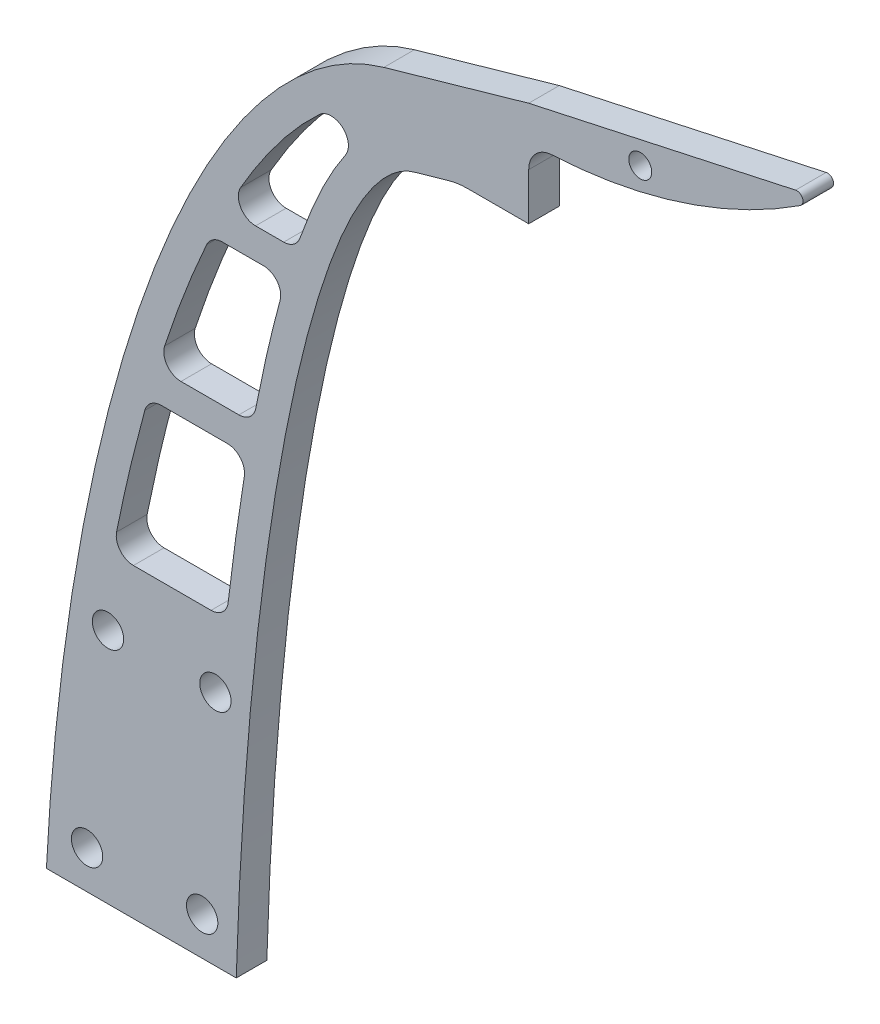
from build123d import *

# Parameters (mm, degrees)
BOSS_EXTRU_1_DEPTH                  = 4
CONG_1_R                            = 3.2
CONG_2_R                            = 0.8
ESQUISSE6_R                         = 1.5
ENL_V_MAT_EXTRU_2_DEPTH             = 4
CONG_4_R                            = 40
CONG_5_R                            = 55
CONG_6_R                            = 5
ENL_V_MAT_EXTRU_3_DEPTH             = 254.580270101
ENL_V_MAT_EXTRU_3_DEPTH_BACK        = 254.580270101
DIAM_TRE_DU_PER_AGE_4_1_4_1_1_D     = 4.1
DIAM_TRE_DU_PER_AGE_4_1_4_1_1_DEPTH = 60
DIAM_TRE_DU_PER_AGE_4_1_4_1_1_TIP   = 1.231764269
ENL_V_MAT_EXTRU_4_DEPTH             = 123.558173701


with BuildPart() as part:
    # Esquisse1 → Boss.-Extru.1 (new body)
    with BuildSketch(Plane.XY):
        with BuildLine():
            Line((-0.739497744, 9.26), (-0.739497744, 0))
            Line((-0.739497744, 0), (-8.739497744, 0))
            ThreePointArc((-8.739497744, 0), (-9.987816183, -0.086992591), (-11.21200252, -0.34628865))
            Line((-11.21200252, -0.34628865), (-15.724973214, -1.635717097))
            add(Edge.make_bspline(
                [(-15.724973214, -1.635717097), (-62.479329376, -14.994190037), (-34.146674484, -194.013963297)],
                knots=[0.059454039, 0.059454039, 0.059454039, 2.220460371, 2.220460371, 2.220460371], degree=2, weights=[1, 0.470884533, 1]))
            add(Edge.make_bspline(
                [(-34.146674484, -194.013963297), (27.242702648, -213.692623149), (101.257172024, -177.705354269)],
                knots=[3.821795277, 3.821795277, 3.821795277, 5.067449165, 5.067449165, 5.067449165], degree=2, weights=[1, 0.812232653, 1]))
            Line((101.257172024, -177.705354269), (109.260502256, -207.574189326))
            add(Edge.make_bspline(
                [(-52.426167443, -205.631123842), (16.317837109, -258.619397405), (109.260502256, -207.574189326)],
                knots=[0.50596565, 0.50596565, 0.50596565, 1.896752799, 1.896752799, 1.896752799], degree=2, weights=[1, 0.767801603, 1]))
            add(Edge.make_bspline(
                [(-19.682682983, 8.247626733), (-113.073085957, -18.435516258), (-52.426167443, -205.631123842)],
                knots=[0.109079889, 0.109079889, 0.109079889, 2.27251572, 2.27251572, 2.27251572], degree=2, weights=[1, 0.469812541, 1]))
            Line((-19.682682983, 8.247626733), (-0.739497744, 13.66))
            Line((-0.739497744, 13.66), (38.077925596, 22.123567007))
            ThreePointArc((38.077925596, 22.123567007), (19.707162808, 12.559642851), (-0.739497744, 9.26))
        make_face()
    extrude(amount=BOSS_EXTRU_1_DEPTH)

    # Cong_1
    cong_1_edges = [part.edges().sort_by_distance(p)[0] for p in [
        (-0.739497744, 9.26, 2),
    ]]
    fillet(cong_1_edges, radius=CONG_1_R)

    # Cong_2
    cong_2_edges = [part.edges().sort_by_distance(p)[0] for p in [
        (38.077925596, 22.123567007, 2),
    ]]
    fillet(cong_2_edges, radius=CONG_2_R)

    # Esquisse6 → Enl_v. mat.-Extru.2 (cut)
    with BuildSketch(Plane.XY.offset(4)):
        with Locations((13.852641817, 13.888758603)):
            Circle(ESQUISSE6_R)
    extrude(amount=-ENL_V_MAT_EXTRU_2_DEPTH, mode=Mode.SUBTRACT)

    # Cong_4
    cong_4_edges = [part.edges().sort_by_distance(p)[0] for p in [
        (-34.146674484, -194.013963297, 2),
    ]]
    fillet(cong_4_edges, radius=CONG_4_R)

    # Cong_5
    cong_5_edges = [part.edges().sort_by_distance(p)[0] for p in [
        (-52.426167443, -205.631123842, 2),
    ]]
    fillet(cong_5_edges, radius=CONG_5_R)

    # Cong_6
    cong_6_edges = [part.edges().sort_by_distance(p)[0] for p in [
        (109.260502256, -207.574189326, 2),
        (101.257172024, -177.705354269, 2),
    ]]
    fillet(cong_6_edges, radius=CONG_6_R)

    # Esquisse7 → Enl_v. mat.-Extru.3 (cut, two sides: drawn at the far end of the back side and taken through both)
    with BuildSketch(Plane.XY.offset(4).offset(-ENL_V_MAT_EXTRU_3_DEPTH_BACK)):
        Polygon((-720.31137096, -104.554103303), (-144.803089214, -104.554103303), (34.773474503, -104.554103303), (610.281756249, -104.554103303), (610.281756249, -1255.570666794), (-720.31137096, -1255.570666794), align=None)
    extrude(amount=ENL_V_MAT_EXTRU_3_DEPTH + ENL_V_MAT_EXTRU_3_DEPTH_BACK, mode=Mode.SUBTRACT)

    # Diam_tre du per_age _4.1 _4.1_1
    with Locations(Plane.XY.offset(4)):
        with Locations((-41.718958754, -73.554103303), (-55.770431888, -73.554103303), (-58.50385532, -99.554103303), (-43.448705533, -99.554103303)):
            Hole(DIAM_TRE_DU_PER_AGE_4_1_4_1_1_D / 2, depth=DIAM_TRE_DU_PER_AGE_4_1_4_1_1_DEPTH)
            with Locations((0, 0, -(DIAM_TRE_DU_PER_AGE_4_1_4_1_1_DEPTH + DIAM_TRE_DU_PER_AGE_4_1_4_1_1_TIP / 2))):  # 118° drill point
                Cone(0, DIAM_TRE_DU_PER_AGE_4_1_4_1_1_D / 2, DIAM_TRE_DU_PER_AGE_4_1_4_1_1_TIP, mode=Mode.SUBTRACT)

    # Esquisse10 → Enl_v. mat.-Extru.4 (cut, through all)
    with BuildSketch(Plane.XY.offset(4)):
        with BuildLine():
            Line((-40.808771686, -22.095564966), (-35.425364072, -22.095564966))
            ThreePointArc((-35.425364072, -22.095564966), (-33.636926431, -22.980284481), (-33.254947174, -24.938684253))
            add(Edge.make_bspline(
                [(-33.254947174, -24.938684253), (-33.890144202, -27.263077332), (-34.499825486, -29.718984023), (-35.553290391, -34.378990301), (-36.006229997, -36.539670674), (-36.44095729, -38.775082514)],
                knots=[0.431957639, 0.431957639, 0.431957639, 0.431957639, 0.5, 0.5, 0.554867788, 0.554867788, 0.554867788, 0.554867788], degree=3))
            ThreePointArc((-36.44095729, -38.775082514), (-37.218481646, -40.081784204), (-38.649580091, -40.595564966))
            Line((-38.649580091, -40.595564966), (-46.219832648, -40.595564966))
            ThreePointArc((-46.219832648, -40.595564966), (-48.042847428, -39.664320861), (-48.356820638, -37.641446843))
            add(Edge.make_bspline(
                [(-42.857603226, -23.415624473), (-43.766209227, -25.417452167), (-44.649489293, -27.512978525), (-46.495251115, -32.230230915), (-47.447717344, -34.882331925), (-48.356820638, -37.641446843)],
                knots=[0.444601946, 0.444601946, 0.444601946, 0.444601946, 0.5, 0.5, 0.564303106, 0.564303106, 0.564303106, 0.564303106], degree=3))
            ThreePointArc((-42.857603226, -23.415624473), (-42.027404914, -22.454154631), (-40.808771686, -22.095564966))
        make_face()
        with BuildLine():
            Line((-48.785844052, -44.595564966), (-40.15812105, -44.595564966))
            ThreePointArc((-40.15812105, -44.595564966), (-38.44483893, -45.387084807), (-37.936976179, -47.204752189))
            add(Edge.make_bspline(
                [(-37.936976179, -47.204752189), (-37.963696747, -47.369987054), (-37.990326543, -47.535541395), (-38.771177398, -52.416001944), (-39.451802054, -57.386963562), (-40.052620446, -62.563509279)],
                knots=[0.621234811, 0.621234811, 0.621234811, 0.621234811, 0.625, 0.625, 0.732018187, 0.732018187, 0.732018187, 0.732018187], degree=3))
            ThreePointArc((-40.052620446, -62.563509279), (-40.791148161, -63.984306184), (-42.287616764, -64.554103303))
            Line((-42.287616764, -64.554103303), (-52.439059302, -64.554103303))
            ThreePointArc((-52.439059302, -64.554103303), (-54.179094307, -63.730559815), (-54.645356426, -61.862795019))
            add(Edge.make_bspline(
                [(-50.954705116, -46.246781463), (-52.322948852, -51.202713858), (-53.558079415, -56.427011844), (-54.645356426, -61.862795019)],
                knots=[0.628736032, 0.628736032, 0.628736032, 0.628736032, 0.736306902, 0.736306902, 0.736306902, 0.736306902], degree=3))
            ThreePointArc((-50.954705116, -46.246781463), (-50.148788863, -45.0553467), (-48.785844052, -44.595564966))
        make_face()
        with BuildLine():
            Line((-32.785595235, -18.095564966), (-36.466631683, -18.095564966))
            ThreePointArc((-36.466631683, -18.095564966), (-38.415450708, -16.970111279), (-38.414664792, -14.719657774))
            add(Edge.make_bspline(
                [(-28.094292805, -1.285962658), (-28.396569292, -1.562681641), (-28.698901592, -1.848903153), (-30.179672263, -3.297901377), (-31.356502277, -4.595829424), (-34.533121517, -8.518620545), (-36.510071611, -11.424350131), (-38.414664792, -14.719657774)],
                knots=[0.171472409, 0.171472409, 0.171472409, 0.171472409, 0.1875, 0.1875, 0.25, 0.25, 0.357804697, 0.357804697, 0.357804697, 0.357804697], degree=3))
            ThreePointArc((-28.094292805, -1.285962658), (-25.095375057, -1.250519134), (-24.725389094, -4.226737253))
            add(Edge.make_bspline(
                [(-24.725389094, -4.226737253), (-24.950883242, -4.552281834), (-25.173069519, -4.887454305), (-26.164638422, -6.445636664), (-26.901692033, -7.778391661), (-28.684062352, -11.416014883), (-29.698707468, -13.873951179), (-30.66509158, -16.597870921)],
                knots=[0.169742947, 0.169742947, 0.169742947, 0.169742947, 0.1875, 0.1875, 0.25, 0.25, 0.343974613, 0.343974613, 0.343974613, 0.343974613], degree=3))
            ThreePointArc((-30.66509158, -16.597870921), (-31.487556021, -17.683388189), (-32.785595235, -18.095564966))
        make_face()
    extrude(amount=-ENL_V_MAT_EXTRU_4_DEPTH, mode=Mode.SUBTRACT)


solid = part.part
